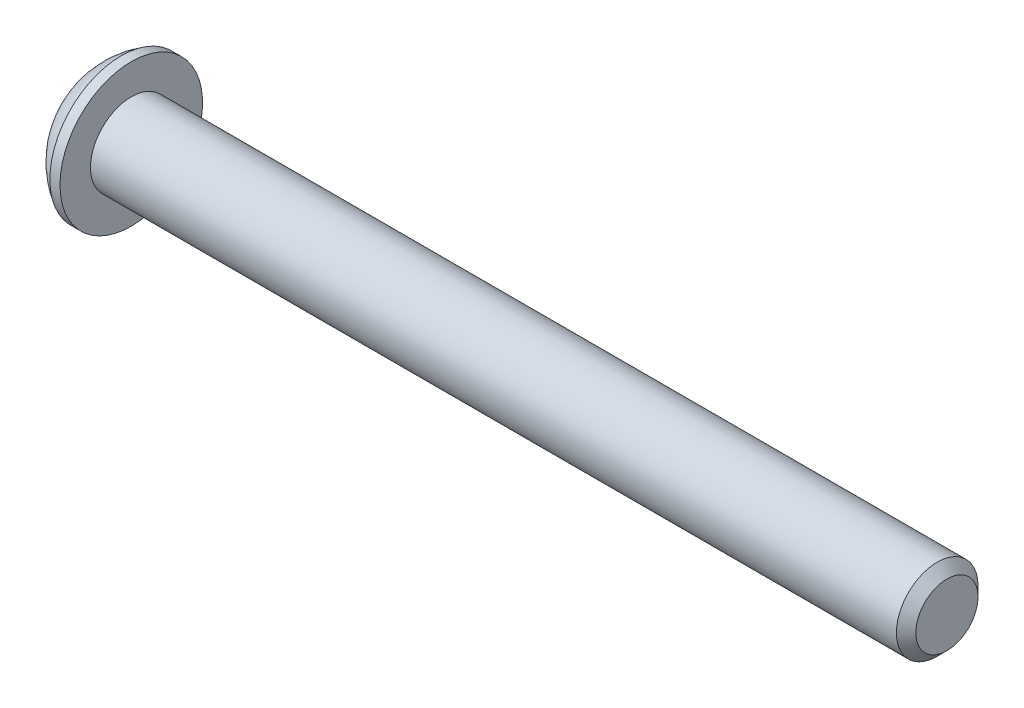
from build123d import *

# Parameters (mm, degrees)
HEX_2_DEPTH = 2.2098


with BuildPart() as part:
    # BodySke → BaseBody (revolve)
    with BuildSketch(Plane.XY, mode=Mode.PRIVATE) as basebody_sk:
        with BuildLine():
            Line((66.8528, 0), (66.8528, 2.41935))
            Line((66.8528, 2.41935), (66.09715, 3.175))
            Line((66.09715, 3.175), (3.3528, 3.175))
            Line((3.3528, 3.175), (3.3528, 5.5499))
            Line((3.3528, 5.5499), (2.5654, 5.5499))
            ThreePointArc((2.5654, 5.5499), (1.073764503, 4.355582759), (0, 2.77495))
            Line((0, 2.77495), (0, 0))
            Line((0, 0), (66.8528, 0))
        make_face()
    revolve(basebody_sk.sketch.rotate(Axis((0, 0, 0), (1, 0, 0)), 90), axis=Axis((0, 0, 0), (1, 0, 0)))

    # Sketch2 → PreBroach (revolve, cut)
    with BuildSketch(Plane.XY, mode=Mode.PRIVATE) as prebroach_sk:
        Polygon((0, 1.9812), (2.2098, 1.9812), (3.353646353, 0), (0, 0), align=None)
    revolve(prebroach_sk.sketch.rotate(Axis((0, 0, 0), (1, 0, 0)), 90), axis=Axis((0, 0, 0), (1, 0, 0)), mode=Mode.SUBTRACT)

    # Sketch3 → Hex 2 (cut)
    with BuildSketch(Plane(origin=(0, 0, 0), x_dir=(0, 0, -1), z_dir=(1, 0, 0))):
        Polygon((-1.9812, -1.143846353), (-1.9812, 1.143846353), (0, 2.287692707), (1.9812, 1.143846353), (1.9812, -1.143846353), (0, -2.287692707), align=None)
    extrude(amount=HEX_2_DEPTH, mode=Mode.SUBTRACT)


solid = part.part
